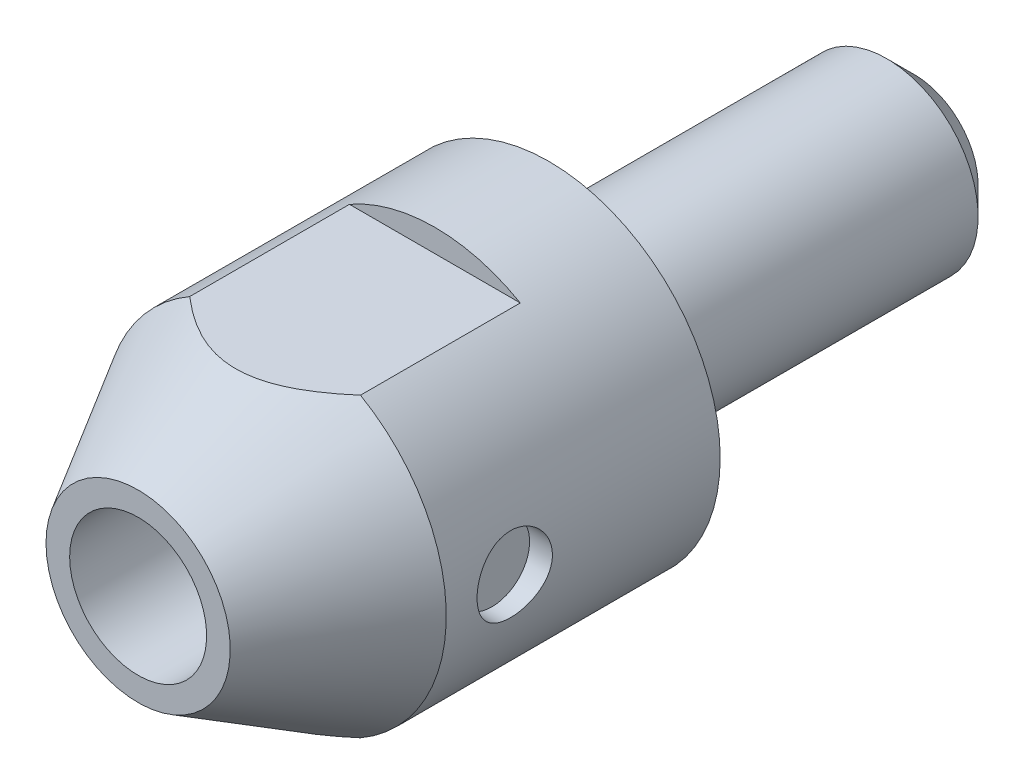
ISO-10303-21;
HEADER;
FILE_DESCRIPTION(('STEP AP214'),'2;1');
FILE_NAME('part.step','',(''),(''),'','','');
FILE_SCHEMA(('AUTOMOTIVE_DESIGN { 1 0 10303 214 1 1 1 1 }'));
ENDSEC;
DATA;
#1=APPLICATION_CONTEXT('core data for automotive mechanical design processes');
#2=APPLICATION_PROTOCOL_DEFINITION('international standard','automotive_design',2000,#1);
#3=PRODUCT_CONTEXT('',#1,'mechanical');
#4=PRODUCT('Part','Part','',(#3));
#5=PRODUCT_RELATED_PRODUCT_CATEGORY('part','',(#4));
#6=PRODUCT_DEFINITION_FORMATION('','',#4);
#7=PRODUCT_DEFINITION_CONTEXT('part definition',#1,'design');
#8=PRODUCT_DEFINITION('design','',#6,#7);
#9=PRODUCT_DEFINITION_SHAPE('','',#8);
#10=(LENGTH_UNIT() NAMED_UNIT(*) SI_UNIT(.MILLI.,.METRE.));
#11=(NAMED_UNIT(*) PLANE_ANGLE_UNIT() SI_UNIT($,.RADIAN.));
#12=(NAMED_UNIT(*) SI_UNIT($,.STERADIAN.) SOLID_ANGLE_UNIT());
#13=UNCERTAINTY_MEASURE_WITH_UNIT(LENGTH_MEASURE(1.E-05),#10,'distance_accuracy_value','');
#14=(GEOMETRIC_REPRESENTATION_CONTEXT(3) GLOBAL_UNCERTAINTY_ASSIGNED_CONTEXT((#13)) GLOBAL_UNIT_ASSIGNED_CONTEXT((#10,
#11,#12)) REPRESENTATION_CONTEXT('',''));
#15=CARTESIAN_POINT('',(0.,0.,0.));
#16=DIRECTION('',(0.,0.,1.));
#17=DIRECTION('',(1.,0.,0.));
#18=AXIS2_PLACEMENT_3D('',#15,#16,#17);
#19=CARTESIAN_POINT('',(-12.6621649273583,0.,9.));
#20=DIRECTION('',(-1.,0.,0.));
#21=DIRECTION('',(0.,0.,1.));
#22=AXIS2_PLACEMENT_3D('',#19,#20,#21);
#23=CYLINDRICAL_SURFACE('',#22,1.65);
#24=CARTESIAN_POINT('',(7.5,0.,10.65));
#25=CARTESIAN_POINT('',(7.49999831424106,0.0914999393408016,10.6499968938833));
#26=CARTESIAN_POINT('',(7.49830854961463,0.183037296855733,10.6423631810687));
#27=CARTESIAN_POINT('',(7.49173097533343,0.363511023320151,10.6120622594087));
#28=CARTESIAN_POINT('',(7.4868408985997,0.452445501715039,10.5893843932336));
#29=CARTESIAN_POINT('',(7.47440705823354,0.625079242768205,10.5297405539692));
#30=CARTESIAN_POINT('',(7.46686608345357,0.708783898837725,10.4927895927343));
#31=CARTESIAN_POINT('',(7.4499439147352,0.868802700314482,10.4056963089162));
#32=CARTESIAN_POINT('',(7.44056276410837,0.945117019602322,10.3555542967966));
#33=CARTESIAN_POINT('',(7.42081741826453,1.08942970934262,10.2426414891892));
#34=CARTESIAN_POINT('',(7.41044091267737,1.15729102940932,10.1796976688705));
#35=CARTESIAN_POINT('',(7.38996090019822,1.28158292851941,10.0433394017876));
#36=CARTESIAN_POINT('',(7.3798574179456,1.33801247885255,9.96992401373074));
#37=CARTESIAN_POINT('',(7.36094592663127,1.43844520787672,9.81369134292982));
#38=CARTESIAN_POINT('',(7.35215368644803,1.48230220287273,9.73077800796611));
#39=CARTESIAN_POINT('',(7.33703697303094,1.55540709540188,9.55853274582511));
#40=CARTESIAN_POINT('',(7.33071220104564,1.58465676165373,9.46920159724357));
#41=CARTESIAN_POINT('',(7.32137195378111,1.62726320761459,9.28814395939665));
#42=CARTESIAN_POINT('',(7.31830597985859,1.64086278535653,9.19647726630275));
#43=CARTESIAN_POINT('',(7.31567882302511,1.65253801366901,9.01211606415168));
#44=CARTESIAN_POINT('',(7.31611720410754,1.65061559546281,8.91942168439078));
#45=CARTESIAN_POINT('',(7.32040352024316,1.63149672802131,8.73744348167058));
#46=CARTESIAN_POINT('',(7.32418842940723,1.61458260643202,8.64812828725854));
#47=CARTESIAN_POINT('',(7.33464165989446,1.56640787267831,8.47363508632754));
#48=CARTESIAN_POINT('',(7.34131014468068,1.53514644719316,8.38845731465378));
#49=CARTESIAN_POINT('',(7.35684109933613,1.45890598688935,8.22386456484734));
#50=CARTESIAN_POINT('',(7.36572078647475,1.41381862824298,8.14450145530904));
#51=CARTESIAN_POINT('',(7.38466310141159,1.31128231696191,7.99436318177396));
#52=CARTESIAN_POINT('',(7.39472589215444,1.25383166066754,7.92358920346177));
#53=CARTESIAN_POINT('',(7.41517081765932,1.12670629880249,7.7910130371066));
#54=CARTESIAN_POINT('',(7.42555512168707,1.05679158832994,7.72944109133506));
#55=CARTESIAN_POINT('',(7.44527255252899,0.907510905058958,7.61885837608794));
#56=CARTESIAN_POINT('',(7.45460565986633,0.828144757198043,7.56984783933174));
#57=CARTESIAN_POINT('',(7.4711999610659,0.661931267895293,7.48572123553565));
#58=CARTESIAN_POINT('',(7.47845660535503,0.575068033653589,7.45063561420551));
#59=CARTESIAN_POINT('',(7.49004657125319,0.396483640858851,7.39562258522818));
#60=CARTESIAN_POINT('',(7.49438032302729,0.304763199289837,7.37569294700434));
#61=CARTESIAN_POINT('',(7.49957488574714,0.121042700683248,7.35189313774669));
#62=CARTESIAN_POINT('',(7.50050369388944,0.0290852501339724,7.34770849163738));
#63=CARTESIAN_POINT('',(7.49897438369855,-0.154214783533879,7.35466469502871));
#64=CARTESIAN_POINT('',(7.4965164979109,-0.245557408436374,7.3658044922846));
#65=CARTESIAN_POINT('',(7.48853291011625,-0.423991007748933,7.40283265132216));
#66=CARTESIAN_POINT('',(7.48304158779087,-0.511117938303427,7.42855581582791));
#67=CARTESIAN_POINT('',(7.46960587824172,-0.679820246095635,7.49383695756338));
#68=CARTESIAN_POINT('',(7.46166128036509,-0.761395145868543,7.5333961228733));
#69=CARTESIAN_POINT('',(7.44403270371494,-0.917976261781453,7.62587978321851));
#70=CARTESIAN_POINT('',(7.43432530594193,-0.992870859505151,7.6789886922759));
#71=CARTESIAN_POINT('',(7.41429527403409,-1.13279771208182,7.79682171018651));
#72=CARTESIAN_POINT('',(7.40397255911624,-1.19782866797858,7.86154734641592));
#73=CARTESIAN_POINT('',(7.38364007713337,-1.31742759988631,8.00222027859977));
#74=CARTESIAN_POINT('',(7.373639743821,-1.37177769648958,8.07835443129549));
#75=CARTESIAN_POINT('',(7.35530407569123,-1.46692164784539,8.23885442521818));
#76=CARTESIAN_POINT('',(7.34696866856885,-1.50771609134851,8.32321990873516));
#77=CARTESIAN_POINT('',(7.33298679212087,-1.57431369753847,8.49733416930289));
#78=CARTESIAN_POINT('',(7.32732517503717,-1.60020149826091,8.58704929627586));
#79=CARTESIAN_POINT('',(7.31930499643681,-1.63649815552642,8.76969698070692));
#80=CARTESIAN_POINT('',(7.3169458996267,-1.64690952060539,8.86262901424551));
#81=CARTESIAN_POINT('',(7.31583187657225,-1.6518500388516,9.0468749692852));
#82=CARTESIAN_POINT('',(7.3169985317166,-1.64672474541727,9.13817931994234));
#83=CARTESIAN_POINT('',(7.32262705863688,-1.62151064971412,9.31858911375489));
#84=CARTESIAN_POINT('',(7.3270888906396,-1.60142202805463,9.40769458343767));
#85=CARTESIAN_POINT('',(7.33876659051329,-1.54701934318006,9.58089887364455));
#86=CARTESIAN_POINT('',(7.34597260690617,-1.5127561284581,9.66501437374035));
#87=CARTESIAN_POINT('',(7.36233049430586,-1.4310203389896,9.82635416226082));
#88=CARTESIAN_POINT('',(7.37148257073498,-1.38354636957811,9.90357772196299));
#89=CARTESIAN_POINT('',(7.39093521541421,-1.27559296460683,10.0506437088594));
#90=CARTESIAN_POINT('',(7.40125543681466,-1.21486750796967,10.1203029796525));
#91=CARTESIAN_POINT('',(7.42175007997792,-1.08263275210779,10.2485559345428));
#92=CARTESIAN_POINT('',(7.43192446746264,-1.01112096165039,10.3071470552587));
#93=CARTESIAN_POINT('',(7.45113988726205,-0.858209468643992,10.4123391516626));
#94=CARTESIAN_POINT('',(7.46016424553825,-0.776692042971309,10.4587722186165));
#95=CARTESIAN_POINT('',(7.47589523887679,-0.606827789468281,10.5372038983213));
#96=CARTESIAN_POINT('',(7.48260380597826,-0.518486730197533,10.5692145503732));
#97=CARTESIAN_POINT('',(7.4917581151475,-0.358388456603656,10.6122237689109));
#98=CARTESIAN_POINT('',(7.4948296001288,-0.287493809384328,10.6263626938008));
#99=CARTESIAN_POINT('',(7.49895116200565,-0.144407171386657,10.645251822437));
#100=CARTESIAN_POINT('',(7.5000013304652,-0.072215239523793,10.6500024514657));
#101=CARTESIAN_POINT('',(7.5,0.,10.65));
#102=B_SPLINE_CURVE_WITH_KNOTS('',3,(#24,#25,#26,#27,#28,#29,#30,#31,#32,#33,#34,#35,#36,#37,
#38,#39,#40,#41,#42,#43,#44,#45,#46,#47,#48,#49,#50,#51,#52,#53,#54,#55,#56,#57,#58,#59,#60,#61,
#62,#63,#64,#65,#66,#67,#68,#69,#70,#71,#72,#73,#74,#75,#76,#77,#78,#79,#80,#81,#82,#83,#84,#85,
#86,#87,#88,#89,#90,#91,#92,#93,#94,#95,#96,#97,#98,#99,#100,#101),.UNSPECIFIED.,.T.,.F.,(4,2,2,
2,2,2,2,2,2,2,2,2,2,2,2,2,2,2,2,2,2,2,2,2,2,2,2,2,2,2,2,2,2,2,2,2,2,2,4),(0.,0.27423546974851,
0.548665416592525,0.822807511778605,1.09694315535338,1.37506480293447,1.65321146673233,
1.93447194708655,2.21569836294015,2.49250033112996,2.76926786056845,3.04093142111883,
3.31261038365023,3.5864747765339,3.86037693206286,4.14027337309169,4.42017499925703,
4.70068528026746,4.98115426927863,5.25599076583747,5.53080839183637,5.80257342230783,
6.07436179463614,6.35006739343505,6.62580926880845,6.90669641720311,7.18757136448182,
7.466835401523,7.74605416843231,8.0191086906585,8.29215991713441,8.56424000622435,
8.83634882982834,9.11402013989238,9.39175567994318,9.67314563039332,9.95430024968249,
10.1707471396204,10.3871842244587),.UNSPECIFIED.);
#103=CARTESIAN_POINT('',(7.5,0.,10.65));
#104=VERTEX_POINT('',#103);
#105=EDGE_CURVE('E161',#104,#104,#102,.T.);
#106=ORIENTED_EDGE('',*,*,#105,.F.);
#107=EDGE_LOOP('',(#106));
#108=FACE_BOUND('',#107,.T.);
#109=CARTESIAN_POINT('',(6.5,0.,9.));
#110=DIRECTION('',(-1.,0.,0.));
#111=DIRECTION('',(0.,0.,1.));
#112=AXIS2_PLACEMENT_3D('',#109,#110,#111);
#113=CIRCLE('',#112,1.65);
#114=CARTESIAN_POINT('',(6.5,0.,10.65));
#115=VERTEX_POINT('',#114);
#116=EDGE_CURVE('E10',#115,#115,#113,.F.);
#117=ORIENTED_EDGE('',*,*,#116,.F.);
#118=EDGE_LOOP('',(#117));
#119=FACE_BOUND('',#118,.T.);
#120=ADVANCED_FACE('F16',(#108,#119),#23,.F.);
#121=CARTESIAN_POINT('',(0.,0.,-38.3689686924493));
#122=DIRECTION('',(0.,0.,-1.));
#123=DIRECTION('',(-1.,0.,0.));
#124=AXIS2_PLACEMENT_3D('',#121,#122,#123);
#125=CYLINDRICAL_SURFACE('',#124,7.5);
#126=CARTESIAN_POINT('',(0.,0.,0.));
#127=DIRECTION('',(0.,0.,-1.));
#128=DIRECTION('',(-1.,0.,0.));
#129=AXIS2_PLACEMENT_3D('',#126,#127,#128);
#130=CIRCLE('',#129,7.5);
#131=CARTESIAN_POINT('',(-7.5,0.,0.));
#132=VERTEX_POINT('',#131);
#133=EDGE_CURVE('E209',#132,#132,#130,.T.);
#134=ORIENTED_EDGE('',*,*,#133,.F.);
#135=EDGE_LOOP('',(#134));
#136=FACE_BOUND('',#135,.T.);
#137=CARTESIAN_POINT('',(0.,0.,12.));
#138=DIRECTION('',(0.,0.,-1.));
#139=DIRECTION('',(-1.,0.,0.));
#140=AXIS2_PLACEMENT_3D('',#137,#138,#139);
#141=CIRCLE('',#140,7.5);
#142=CARTESIAN_POINT('',(3.74165738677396,6.5,12.));
#143=VERTEX_POINT('',#142);
#144=CARTESIAN_POINT('',(3.74165738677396,-6.5,12.));
#145=VERTEX_POINT('',#144);
#146=EDGE_CURVE('E213',#143,#145,#141,.T.);
#147=ORIENTED_EDGE('',*,*,#146,.T.);
#148=DIRECTION('',(0.,0.,-1.));
#149=VECTOR('',#148,1.);
#150=CARTESIAN_POINT('',(3.74165738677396,-6.5,-38.3689686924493));
#151=LINE('',#150,#149);
#152=CARTESIAN_POINT('',(3.74165738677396,-6.5,5.));
#153=VERTEX_POINT('',#152);
#154=EDGE_CURVE('E238',#145,#153,#151,.T.);
#155=ORIENTED_EDGE('',*,*,#154,.T.);
#156=CARTESIAN_POINT('',(0.,0.,5.));
#157=DIRECTION('',(0.,0.,1.));
#158=DIRECTION('',(1.,0.,0.));
#159=AXIS2_PLACEMENT_3D('',#156,#157,#158);
#160=CIRCLE('',#159,7.5);
#161=CARTESIAN_POINT('',(-3.74165738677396,-6.5,5.));
#162=VERTEX_POINT('',#161);
#163=EDGE_CURVE('E233',#162,#153,#160,.T.);
#164=ORIENTED_EDGE('',*,*,#163,.F.);
#165=DIRECTION('',(0.,0.,-1.));
#166=VECTOR('',#165,1.);
#167=CARTESIAN_POINT('',(-3.74165738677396,-6.5,-38.3689686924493));
#168=LINE('',#167,#166);
#169=CARTESIAN_POINT('',(-3.74165738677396,-6.5,12.));
#170=VERTEX_POINT('',#169);
#171=EDGE_CURVE('E235',#162,#170,#168,.F.);
#172=ORIENTED_EDGE('',*,*,#171,.T.);
#173=CARTESIAN_POINT('',(-3.74165738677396,6.5,12.));
#174=VERTEX_POINT('',#173);
#175=EDGE_CURVE('E212',#170,#174,#141,.T.);
#176=ORIENTED_EDGE('',*,*,#175,.T.);
#177=DIRECTION('',(0.,0.,-1.));
#178=VECTOR('',#177,1.);
#179=CARTESIAN_POINT('',(-3.74165738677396,6.5,-38.3689686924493));
#180=LINE('',#179,#178);
#181=CARTESIAN_POINT('',(-3.74165738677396,6.5,5.));
#182=VERTEX_POINT('',#181);
#183=EDGE_CURVE('E230',#174,#182,#180,.T.);
#184=ORIENTED_EDGE('',*,*,#183,.T.);
#185=CARTESIAN_POINT('',(0.,0.,5.));
#186=DIRECTION('',(0.,0.,1.));
#187=DIRECTION('',(1.,0.,0.));
#188=AXIS2_PLACEMENT_3D('',#185,#186,#187);
#189=CIRCLE('',#188,7.5);
#190=CARTESIAN_POINT('',(3.74165738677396,6.5,5.));
#191=VERTEX_POINT('',#190);
#192=EDGE_CURVE('E225',#191,#182,#189,.T.);
#193=ORIENTED_EDGE('',*,*,#192,.F.);
#194=DIRECTION('',(0.,0.,-1.));
#195=VECTOR('',#194,1.);
#196=CARTESIAN_POINT('',(3.74165738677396,6.5,-38.3689686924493));
#197=LINE('',#196,#195);
#198=EDGE_CURVE('E227',#191,#143,#197,.F.);
#199=ORIENTED_EDGE('',*,*,#198,.T.);
#200=EDGE_LOOP('',(#147,#155,#164,#172,#176,#184,#193,#199));
#201=FACE_BOUND('',#200,.T.);
#202=ORIENTED_EDGE('',*,*,#105,.T.);
#203=EDGE_LOOP('',(#202));
#204=FACE_BOUND('',#203,.T.);
#205=CARTESIAN_POINT('',(-7.5,0.,10.0196551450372));
#206=CARTESIAN_POINT('',(-7.49999815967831,0.112035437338,10.0196526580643));
#207=CARTESIAN_POINT('',(-7.49746541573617,0.224101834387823,10.0104770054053));
#208=CARTESIAN_POINT('',(-7.48760100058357,0.445065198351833,9.97400781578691));
#209=CARTESIAN_POINT('',(-7.48026698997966,0.553960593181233,9.94670544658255));
#210=CARTESIAN_POINT('',(-7.46159520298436,0.765415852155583,9.87471725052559));
#211=CARTESIAN_POINT('',(-7.4502595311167,0.867979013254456,9.83004055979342));
#212=CARTESIAN_POINT('',(-7.42480411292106,1.06398412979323,9.7244409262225));
#213=CARTESIAN_POINT('',(-7.41068441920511,1.1574262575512,9.66351829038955));
#214=CARTESIAN_POINT('',(-7.38111530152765,1.33308802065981,9.52657346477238));
#215=CARTESIAN_POINT('',(-7.36565918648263,1.41524513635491,9.450472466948));
#216=CARTESIAN_POINT('',(-7.33521511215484,1.56540829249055,9.28531014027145));
#217=CARTESIAN_POINT('',(-7.32022712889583,1.63341505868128,9.19624947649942));
#218=CARTESIAN_POINT('',(-7.29254399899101,1.75286903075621,9.00819917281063));
#219=CARTESIAN_POINT('',(-7.2798335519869,1.80442870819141,8.90928331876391));
#220=CARTESIAN_POINT('',(-7.25805924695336,1.89011767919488,8.70380566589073));
#221=CARTESIAN_POINT('',(-7.24899468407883,1.92425034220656,8.59724534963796));
#222=CARTESIAN_POINT('',(-7.23569834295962,1.97365524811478,8.3819641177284));
#223=CARTESIAN_POINT('',(-7.23136755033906,1.98931447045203,8.27333785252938));
#224=CARTESIAN_POINT('',(-7.22762203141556,2.0028804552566,8.05490996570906));
#225=CARTESIAN_POINT('',(-7.22820739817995,2.00078688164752,7.94510832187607));
#226=CARTESIAN_POINT('',(-7.2341453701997,1.97920713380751,7.72696682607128));
#227=CARTESIAN_POINT('',(-7.23951578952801,1.95965596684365,7.61863397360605));
#228=CARTESIAN_POINT('',(-7.25436749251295,1.90393658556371,7.40662835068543));
#229=CARTESIAN_POINT('',(-7.26384974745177,1.86776444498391,7.30295668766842));
#230=CARTESIAN_POINT('',(-7.28635469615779,1.77799391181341,7.09834186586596));
#231=CARTESIAN_POINT('',(-7.29951483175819,1.7236986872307,6.99771955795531));
#232=CARTESIAN_POINT('',(-7.32769468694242,1.5996643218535,6.80675519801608));
#233=CARTESIAN_POINT('',(-7.34271496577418,1.52992053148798,6.71641625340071));
#234=CARTESIAN_POINT('',(-7.37355344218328,1.37377563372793,6.54532048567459));
#235=CARTESIAN_POINT('',(-7.38938075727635,1.28685961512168,6.46503353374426));
#236=CARTESIAN_POINT('',(-7.4194621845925,1.10022453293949,6.32064252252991));
#237=CARTESIAN_POINT('',(-7.43371652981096,1.00050737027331,6.25653606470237));
#238=CARTESIAN_POINT('',(-7.45858563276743,0.793746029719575,6.14846063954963));
#239=CARTESIAN_POINT('',(-7.46928896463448,0.686975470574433,6.10399064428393));
#240=CARTESIAN_POINT('',(-7.48626258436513,0.466921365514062,6.03466639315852));
#241=CARTESIAN_POINT('',(-7.49253535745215,0.353641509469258,6.00980113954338));
#242=CARTESIAN_POINT('',(-7.49959575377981,0.132224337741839,5.98189545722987));
#243=CARTESIAN_POINT('',(-7.50073204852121,0.0242716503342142,5.97746725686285));
#244=CARTESIAN_POINT('',(-7.49834383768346,-0.190772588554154,5.98685322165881));
#245=CARTESIAN_POINT('',(-7.49482014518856,-0.297864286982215,6.0006642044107));
#246=CARTESIAN_POINT('',(-7.48369023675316,-0.504778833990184,6.04520076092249));
#247=CARTESIAN_POINT('',(-7.47621204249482,-0.604723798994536,6.07539665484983));
#248=CARTESIAN_POINT('',(-7.45802983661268,-0.798279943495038,6.15115705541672));
#249=CARTESIAN_POINT('',(-7.44732530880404,-0.891890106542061,6.1967240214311));
#250=CARTESIAN_POINT('',(-7.42325913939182,-1.07425634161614,6.30380040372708));
#251=CARTESIAN_POINT('',(-7.40980826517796,-1.16266795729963,6.36587512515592));
#252=CARTESIAN_POINT('',(-7.38188083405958,-1.32850317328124,6.50309789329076));
#253=CARTESIAN_POINT('',(-7.36740391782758,-1.40592289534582,6.5782505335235));
#254=CARTESIAN_POINT('',(-7.33785540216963,-1.553025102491,6.74512700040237));
#255=CARTESIAN_POINT('',(-7.32280945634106,-1.62183479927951,6.83762618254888));
#256=CARTESIAN_POINT('',(-7.29479126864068,-1.74354022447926,7.03286769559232));
#257=CARTESIAN_POINT('',(-7.28181948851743,-1.79643241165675,7.13561229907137));
#258=CARTESIAN_POINT('',(-7.25915438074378,-1.88596912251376,7.35152201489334));
#259=CARTESIAN_POINT('',(-7.24955568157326,-1.92215247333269,7.46488939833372));
#260=CARTESIAN_POINT('',(-7.23540110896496,-1.97477282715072,7.69642408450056));
#261=CARTESIAN_POINT('',(-7.23084376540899,-1.99121558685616,7.81458997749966));
#262=CARTESIAN_POINT('',(-7.2275386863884,-2.00317761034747,8.04768937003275));
#263=CARTESIAN_POINT('',(-7.22858259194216,-1.999447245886,8.16258105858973));
#264=CARTESIAN_POINT('',(-7.23597135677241,-1.97253954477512,8.38988362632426));
#265=CARTESIAN_POINT('',(-7.24231485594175,-1.94936719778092,8.50229513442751));
#266=CARTESIAN_POINT('',(-7.25919799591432,-1.88548984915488,8.71643629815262));
#267=CARTESIAN_POINT('',(-7.26954776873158,-1.84557214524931,8.81841690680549));
#268=CARTESIAN_POINT('',(-7.29326976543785,-1.74947242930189,9.01401463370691));
#269=CARTESIAN_POINT('',(-7.30664200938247,-1.69329030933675,9.10763169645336));
#270=CARTESIAN_POINT('',(-7.33493173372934,-1.56620632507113,9.28407920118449));
#271=CARTESIAN_POINT('',(-7.34985011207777,-1.49529588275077,9.36690331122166));
#272=CARTESIAN_POINT('',(-7.37961244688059,-1.34071059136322,9.51966754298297));
#273=CARTESIAN_POINT('',(-7.39445638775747,-1.25703317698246,9.58960506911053));
#274=CARTESIAN_POINT('',(-7.42280239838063,-1.07724301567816,9.71625494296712));
#275=CARTESIAN_POINT('',(-7.4362688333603,-0.98090193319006,9.77265125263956));
#276=CARTESIAN_POINT('',(-7.46002249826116,-0.779923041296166,9.86880738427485));
#277=CARTESIAN_POINT('',(-7.47031119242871,-0.675289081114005,9.90857487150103));
#278=CARTESIAN_POINT('',(-7.48545158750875,-0.475966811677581,9.96606774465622));
#279=CARTESIAN_POINT('',(-7.49086925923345,-0.381986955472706,9.98612713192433));
#280=CARTESIAN_POINT('',(-7.49814421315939,-0.192012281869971,10.0129217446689));
#281=CARTESIAN_POINT('',(-7.50000157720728,-0.0960175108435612,10.0196572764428));
#282=CARTESIAN_POINT('',(-7.5,0.,10.0196551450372));
#283=B_SPLINE_CURVE_WITH_KNOTS('',3,(#205,#206,#207,#208,#209,#210,#211,#212,#213,#214,#215,
#216,#217,#218,#219,#220,#221,#222,#223,#224,#225,#226,#227,#228,#229,#230,#231,#232,#233,#234,
#235,#236,#237,#238,#239,#240,#241,#242,#243,#244,#245,#246,#247,#248,#249,#250,#251,#252,#253,
#254,#255,#256,#257,#258,#259,#260,#261,#262,#263,#264,#265,#266,#267,#268,#269,#270,#271,#272,
#273,#274,#275,#276,#277,#278,#279,#280,#281,#282),.UNSPECIFIED.,.T.,.F.,(4,2,2,2,2,2,2,2,2,2,2,
2,2,2,2,2,2,2,2,2,2,2,2,2,2,2,2,2,2,2,2,2,2,2,2,2,2,2,4),(0.,0.335760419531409,
0.671684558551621,1.00743229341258,1.34317368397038,1.68070592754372,2.01822085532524,
2.35337562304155,2.68846556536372,3.01640388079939,3.34434840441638,3.67351894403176,
4.00276728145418,4.34650499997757,4.69034631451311,5.04673294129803,5.40306670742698,
5.74969285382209,6.09612441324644,6.41864763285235,6.74111458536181,7.0537292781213,
7.36639401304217,7.69157841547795,8.01687726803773,8.36409409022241,8.7113881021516,
9.06776618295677,9.42404031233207,9.76715557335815,10.110182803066,10.438626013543,
10.7670714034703,11.0957086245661,11.4244119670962,11.76016963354,12.0957723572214,
12.3835350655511,12.6712911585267),.UNSPECIFIED.);
#284=CARTESIAN_POINT('',(-7.5,0.,10.0196551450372));
#285=VERTEX_POINT('',#284);
#286=EDGE_CURVE('E24',#285,#285,#283,.T.);
#287=ORIENTED_EDGE('',*,*,#286,.F.);
#288=EDGE_LOOP('',(#287));
#289=FACE_BOUND('',#288,.T.);
#290=ADVANCED_FACE('F249',(#136,#201,#204,#289),#125,.T.);
#291=CARTESIAN_POINT('',(0.,0.,-38.3689686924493));
#292=DIRECTION('',(0.,0.,-1.));
#293=DIRECTION('',(-1.,0.,0.));
#294=AXIS2_PLACEMENT_3D('',#291,#292,#293);
#295=CYLINDRICAL_SURFACE('',#294,4.);
#296=CARTESIAN_POINT('',(0.,0.,-14.8));
#297=DIRECTION('',(0.,0.,-1.));
#298=DIRECTION('',(-1.,0.,0.));
#299=AXIS2_PLACEMENT_3D('',#296,#297,#298);
#300=CIRCLE('',#299,4.);
#301=CARTESIAN_POINT('',(-4.,0.,-14.8));
#302=VERTEX_POINT('',#301);
#303=EDGE_CURVE('E206',#302,#302,#300,.T.);
#304=ORIENTED_EDGE('',*,*,#303,.F.);
#305=EDGE_LOOP('',(#304));
#306=FACE_BOUND('',#305,.T.);
#307=CARTESIAN_POINT('',(0.,0.,0.));
#308=DIRECTION('',(0.,0.,1.));
#309=DIRECTION('',(1.,0.,0.));
#310=AXIS2_PLACEMENT_3D('',#307,#308,#309);
#311=CIRCLE('',#310,4.);
#312=CARTESIAN_POINT('',(4.,0.,0.));
#313=VERTEX_POINT('',#312);
#314=EDGE_CURVE('E158',#313,#313,#311,.F.);
#315=ORIENTED_EDGE('',*,*,#314,.T.);
#316=EDGE_LOOP('',(#315));
#317=FACE_BOUND('',#316,.T.);
#318=ADVANCED_FACE('F404',(#306,#317),#295,.T.);
#319=CARTESIAN_POINT('',(0.,0.,-14.8));
#320=DIRECTION('',(0.,0.,1.));
#321=DIRECTION('',(1.,0.,0.));
#322=AXIS2_PLACEMENT_3D('',#319,#320,#321);
#323=CONICAL_SURFACE('',#322,4.,0.785398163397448);
#324=CARTESIAN_POINT('',(0.,0.,-16.));
#325=DIRECTION('',(0.,0.,-1.));
#326=DIRECTION('',(-1.,0.,0.));
#327=AXIS2_PLACEMENT_3D('',#324,#325,#326);
#328=CIRCLE('',#327,2.8);
#329=CARTESIAN_POINT('',(-2.8,0.,-16.));
#330=VERTEX_POINT('',#329);
#331=EDGE_CURVE('E203',#330,#330,#328,.T.);
#332=ORIENTED_EDGE('',*,*,#331,.F.);
#333=EDGE_LOOP('',(#332));
#334=FACE_BOUND('',#333,.T.);
#335=ORIENTED_EDGE('',*,*,#303,.T.);
#336=EDGE_LOOP('',(#335));
#337=FACE_BOUND('',#336,.T.);
#338=ADVANCED_FACE('F413',(#334,#337),#323,.T.);
#339=CARTESIAN_POINT('',(2.8,0.,-16.));
#340=DIRECTION('',(0.,0.,1.));
#341=DIRECTION('',(1.,0.,0.));
#342=AXIS2_PLACEMENT_3D('',#339,#340,#341);
#343=PLANE('',#342);
#344=ORIENTED_EDGE('',*,*,#331,.T.);
#345=EDGE_LOOP('',(#344));
#346=FACE_BOUND('',#345,.T.);
#347=ADVANCED_FACE('F194',(#346),#343,.F.);
#348=CARTESIAN_POINT('',(3.,0.,18.));
#349=DIRECTION('',(0.,0.,-1.));
#350=DIRECTION('',(-1.,0.,0.));
#351=AXIS2_PLACEMENT_3D('',#348,#349,#350);
#352=PLANE('',#351);
#353=CARTESIAN_POINT('',(0.,0.,18.));
#354=DIRECTION('',(0.,0.,-1.));
#355=DIRECTION('',(-1.,0.,0.));
#356=AXIS2_PLACEMENT_3D('',#353,#354,#355);
#357=CIRCLE('',#356,4.03589838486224);
#358=CARTESIAN_POINT('',(-4.03589838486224,0.,18.));
#359=VERTEX_POINT('',#358);
#360=EDGE_CURVE('E216',#359,#359,#357,.T.);
#361=ORIENTED_EDGE('',*,*,#360,.F.);
#362=EDGE_LOOP('',(#361));
#363=FACE_BOUND('',#362,.T.);
#364=CARTESIAN_POINT('',(0.,0.,18.));
#365=DIRECTION('',(0.,0.,-1.));
#366=DIRECTION('',(-1.,0.,0.));
#367=AXIS2_PLACEMENT_3D('',#364,#365,#366);
#368=CIRCLE('',#367,3.);
#369=CARTESIAN_POINT('',(-3.,0.,18.));
#370=VERTEX_POINT('',#369);
#371=EDGE_CURVE('E219',#370,#370,#368,.T.);
#372=ORIENTED_EDGE('',*,*,#371,.T.);
#373=EDGE_LOOP('',(#372));
#374=FACE_BOUND('',#373,.T.);
#375=ADVANCED_FACE('F189',(#363,#374),#352,.F.);
#376=CARTESIAN_POINT('',(-9.6,6.5,5.));
#377=DIRECTION('',(0.,0.,1.));
#378=DIRECTION('',(1.,0.,0.));
#379=AXIS2_PLACEMENT_3D('',#376,#377,#378);
#380=PLANE('',#379);
#381=ORIENTED_EDGE('',*,*,#192,.T.);
#382=DIRECTION('',(1.,0.,0.));
#383=VECTOR('',#382,1.);
#384=CARTESIAN_POINT('',(-9.6,6.5,5.));
#385=LINE('',#384,#383);
#386=EDGE_CURVE('E37',#182,#191,#385,.T.);
#387=ORIENTED_EDGE('',*,*,#386,.T.);
#388=EDGE_LOOP('',(#381,#387));
#389=FACE_BOUND('',#388,.T.);
#390=ADVANCED_FACE('F185',(#389),#380,.T.);
#391=CARTESIAN_POINT('',(-9.6,6.5,5.));
#392=DIRECTION('',(0.,-1.,0.));
#393=DIRECTION('',(0.,0.,-1.));
#394=AXIS2_PLACEMENT_3D('',#391,#392,#393);
#395=PLANE('',#394);
#396=CARTESIAN_POINT('',(-9.35809838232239,6.5,5.2553356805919));
#397=CARTESIAN_POINT('',(-9.19191981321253,6.5,5.4917084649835));
#398=CARTESIAN_POINT('',(-9.02479859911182,6.5,5.72742378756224));
#399=CARTESIAN_POINT('',(-8.6883280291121,6.5,6.19726699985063));
#400=CARTESIAN_POINT('',(-8.51897861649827,6.5,6.43139484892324));
#401=CARTESIAN_POINT('',(-8.17727099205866,6.5,6.89838838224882));
#402=CARTESIAN_POINT('',(-8.00490606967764,6.5,7.13124916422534));
#403=CARTESIAN_POINT('',(-7.65715770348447,6.5,7.59471575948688));
#404=CARTESIAN_POINT('',(-7.48177420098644,6.5,7.82532152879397));
#405=CARTESIAN_POINT('',(-7.11385053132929,6.5,8.30139308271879));
#406=CARTESIAN_POINT('',(-6.92102696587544,6.5,8.54664041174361));
#407=CARTESIAN_POINT('',(-6.53041673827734,6.5,9.03313385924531));
#408=CARTESIAN_POINT('',(-6.33263040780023,6.5,9.27438024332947));
#409=CARTESIAN_POINT('',(-5.93121046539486,6.5,9.75148921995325));
#410=CARTESIAN_POINT('',(-5.72758414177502,6.5,9.98735791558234));
#411=CARTESIAN_POINT('',(-5.31282641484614,6.5,10.4523819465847));
#412=CARTESIAN_POINT('',(-5.10169572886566,6.5,10.6815379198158));
#413=CARTESIAN_POINT('',(-4.65558229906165,6.5,11.1458412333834));
#414=CARTESIAN_POINT('',(-4.41994753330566,6.5,11.3803709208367));
#415=CARTESIAN_POINT('',(-4.05617177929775,6.5,11.7209934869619));
#416=CARTESIAN_POINT('',(-3.93323025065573,6.5,11.8326411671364));
#417=CARTESIAN_POINT('',(-3.68335894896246,6.5,12.0514297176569));
#418=CARTESIAN_POINT('',(-3.55642878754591,6.5,12.1585701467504));
#419=CARTESIAN_POINT('',(-3.30036232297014,6.5,12.365429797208));
#420=CARTESIAN_POINT('',(-3.17130580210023,6.5,12.4652473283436));
#421=CARTESIAN_POINT('',(-2.90832306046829,6.5,12.6582087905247));
#422=CARTESIAN_POINT('',(-2.77439830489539,6.5,12.7513547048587));
#423=CARTESIAN_POINT('',(-2.5014431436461,6.5,12.9291294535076));
#424=CARTESIAN_POINT('',(-2.36242614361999,6.5,13.0137787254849));
#425=CARTESIAN_POINT('',(-2.07861608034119,6.5,13.1726864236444));
#426=CARTESIAN_POINT('',(-1.93382688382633,6.5,13.2469516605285));
#427=CARTESIAN_POINT('',(-1.67922365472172,6.5,13.3637929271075));
#428=CARTESIAN_POINT('',(-1.57082517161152,6.5,13.4094497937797));
#429=CARTESIAN_POINT('',(-1.35102129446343,6.5,13.4929336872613));
#430=CARTESIAN_POINT('',(-1.23961580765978,6.5,13.5307604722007));
#431=CARTESIAN_POINT('',(-1.01424777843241,6.5,13.5974371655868));
#432=CARTESIAN_POINT('',(-0.900287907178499,6.5,13.6262960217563));
#433=CARTESIAN_POINT('',(-0.670308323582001,6.5,13.6740710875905));
#434=CARTESIAN_POINT('',(-0.554289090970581,6.5,13.6929895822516));
#435=CARTESIAN_POINT('',(-0.320007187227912,6.5,13.7202476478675));
#436=CARTESIAN_POINT('',(-0.201733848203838,6.5,13.7284966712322));
#437=CARTESIAN_POINT('',(0.035060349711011,6.5,13.7337543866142));
#438=CARTESIAN_POINT('',(0.153581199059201,6.5,13.7307635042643));
#439=CARTESIAN_POINT('',(0.389880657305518,6.5,13.7136712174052));
#440=CARTESIAN_POINT('',(0.50765879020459,6.5,13.6995632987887));
#441=CARTESIAN_POINT('',(0.741466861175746,6.5,13.6608331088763));
#442=CARTESIAN_POINT('',(0.857496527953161,6.5,13.6362092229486));
#443=CARTESIAN_POINT('',(1.11262531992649,6.5,13.5708348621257));
#444=CARTESIAN_POINT('',(1.25111628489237,6.5,13.5277158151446));
#445=CARTESIAN_POINT('',(1.52366852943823,6.5,13.4291827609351));
#446=CARTESIAN_POINT('',(1.65772728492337,6.5,13.3737618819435));
#447=CARTESIAN_POINT('',(1.92144625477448,6.5,13.2525263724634));
#448=CARTESIAN_POINT('',(2.05109380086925,6.5,13.1866844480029));
#449=CARTESIAN_POINT('',(2.3056847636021,6.5,13.0465607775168));
#450=CARTESIAN_POINT('',(2.43062858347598,6.5,12.9722797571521));
#451=CARTESIAN_POINT('',(2.71377760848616,6.5,12.792970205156));
#452=CARTESIAN_POINT('',(2.87043024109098,6.5,12.6854989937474));
#453=CARTESIAN_POINT('',(3.17711429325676,6.5,12.4614477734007));
#454=CARTESIAN_POINT('',(3.32714262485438,6.5,12.3448635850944));
#455=CARTESIAN_POINT('',(3.62163685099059,6.5,12.10441583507));
#456=CARTESIAN_POINT('',(3.76609291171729,6.5,11.9805402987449));
#457=CARTESIAN_POINT('',(4.04999178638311,6.5,11.7271645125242));
#458=CARTESIAN_POINT('',(4.18943393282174,6.5,11.5976635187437));
#459=CARTESIAN_POINT('',(4.46579742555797,6.5,11.332422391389));
#460=CARTESIAN_POINT('',(4.60266114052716,6.5,11.1966224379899));
#461=CARTESIAN_POINT('',(4.87255887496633,6.5,10.9212722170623));
#462=CARTESIAN_POINT('',(5.00559276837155,6.5,10.781721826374));
#463=CARTESIAN_POINT('',(5.26818990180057,6.5,10.4997052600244));
#464=CARTESIAN_POINT('',(5.39775701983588,6.5,10.3572426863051));
#465=CARTESIAN_POINT('',(5.65400753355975,6.5,10.0697633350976));
#466=CARTESIAN_POINT('',(5.78069104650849,6.5,9.92474666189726));
#467=CARTESIAN_POINT('',(6.05393195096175,6.5,9.60648225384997));
#468=CARTESIAN_POINT('',(6.20000078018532,6.5,9.43281548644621));
#469=CARTESIAN_POINT('',(6.48913957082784,6.5,9.08300028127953));
#470=CARTESIAN_POINT('',(6.63220943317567,6.5,8.90685176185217));
#471=CARTESIAN_POINT('',(7.05758164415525,6.5,8.37525935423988));
#472=CARTESIAN_POINT('',(7.33600868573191,6.5,8.0167132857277));
#473=CARTESIAN_POINT('',(7.88512567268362,6.5,7.29347349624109));
#474=CARTESIAN_POINT('',(8.15581130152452,6.5,6.92877651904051));
#475=CARTESIAN_POINT('',(8.69101435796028,6.5,6.1948749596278));
#476=CARTESIAN_POINT('',(8.95553158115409,6.5,5.82567022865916));
#477=CARTESIAN_POINT('',(9.48037165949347,6.5,5.08275403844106));
#478=CARTESIAN_POINT('',(9.74068074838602,6.5,4.70903287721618));
#479=CARTESIAN_POINT('',(10.2572871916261,6.5,3.95882368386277));
#480=CARTESIAN_POINT('',(10.5135844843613,6.5,3.58233560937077));
#481=CARTESIAN_POINT('',(11.0227892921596,6.5,2.82726417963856));
#482=CARTESIAN_POINT('',(11.2756979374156,6.5,2.44868158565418));
#483=CARTESIAN_POINT('',(11.7787632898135,6.5,1.68969242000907));
#484=CARTESIAN_POINT('',(12.0289199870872,6.5,1.30928584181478));
#485=CARTESIAN_POINT('',(12.7168074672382,6.5,0.256302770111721));
#486=CARTESIAN_POINT('',(13.1521069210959,6.5,-0.417861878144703));
#487=CARTESIAN_POINT('',(14.0173339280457,6.5,-1.76971456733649));
#488=CARTESIAN_POINT('',(14.4472609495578,6.5,-2.44740294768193));
#489=CARTESIAN_POINT('',(15.3006656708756,6.5,-3.80187505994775));
#490=CARTESIAN_POINT('',(15.7241653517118,6.5,-4.47864495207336));
#491=CARTESIAN_POINT('',(16.3569076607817,6.5,-5.49530030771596));
#492=CARTESIAN_POINT('',(16.5673910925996,6.5,-5.83441471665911));
#493=CARTESIAN_POINT('',(16.9876118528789,6.5,-6.51310461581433));
#494=CARTESIAN_POINT('',(17.1973491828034,6.5,-6.85268010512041));
#495=CARTESIAN_POINT('',(17.4067542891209,6.5,-7.19246040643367));
#496=B_SPLINE_CURVE_WITH_KNOTS('',3,(#396,#397,#398,#399,#400,#401,#402,#403,#404,#405,#406,
#407,#408,#409,#410,#411,#412,#413,#414,#415,#416,#417,#418,#419,#420,#421,#422,#423,#424,#425,
#426,#427,#428,#429,#430,#431,#432,#433,#434,#435,#436,#437,#438,#439,#440,#441,#442,#443,#444,
#445,#446,#447,#448,#449,#450,#451,#452,#453,#454,#455,#456,#457,#458,#459,#460,#461,#462,#463,
#464,#465,#466,#467,#468,#469,#470,#471,#472,#473,#474,#475,#476,#477,#478,#479,#480,#481,#482,
#483,#484,#485,#486,#487,#488,#489,#490,#491,#492,#493,#494,#495),.UNSPECIFIED.,.F.,.F.,(4,2,2,
2,2,2,2,2,2,2,2,2,2,2,2,2,2,2,2,2,2,2,2,2,2,2,2,2,2,2,2,2,2,2,2,2,2,2,2,2,2,2,2,2,2,2,2,2,2,4),
(0.,0.866829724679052,1.7336815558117,2.60280044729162,3.47193625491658,4.40780209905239,
5.3436055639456,6.27828802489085,7.21288138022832,8.20972790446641,8.70785838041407,
9.2060375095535,9.69532711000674,10.1844706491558,10.6724079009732,11.1600236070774,
11.5126329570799,11.865253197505,12.2175204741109,12.5697067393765,12.9248626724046,
13.2800051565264,13.635355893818,13.9907612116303,14.4252058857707,14.8598938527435,
15.2957397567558,15.7315482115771,16.3010292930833,16.8707730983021,17.4414802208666,
18.0122630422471,18.5905857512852,19.1689274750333,19.7465926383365,20.3242342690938,
21.0049764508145,21.6857410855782,23.047446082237,24.4098961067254,25.7723912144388,
27.1386888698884,28.5050074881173,29.8708584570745,31.2367143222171,33.6441331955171,
36.0517884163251,38.4468382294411,39.6442166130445,40.8415926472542),.UNSPECIFIED.);
#497=EDGE_CURVE('E196',#143,#174,#496,.F.);
#498=ORIENTED_EDGE('',*,*,#497,.F.);
#499=ORIENTED_EDGE('',*,*,#198,.F.);
#500=ORIENTED_EDGE('',*,*,#386,.F.);
#501=ORIENTED_EDGE('',*,*,#183,.F.);
#502=EDGE_LOOP('',(#498,#499,#500,#501));
#503=FACE_BOUND('',#502,.T.);
#504=ADVANCED_FACE('F188',(#503),#395,.F.);
#505=CARTESIAN_POINT('',(10.0243093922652,-12.917679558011,5.));
#506=DIRECTION('',(0.,0.,1.));
#507=DIRECTION('',(1.,0.,0.));
#508=AXIS2_PLACEMENT_3D('',#505,#506,#507);
#509=PLANE('',#508);
#510=ORIENTED_EDGE('',*,*,#163,.T.);
#511=DIRECTION('',(-1.,0.,0.));
#512=VECTOR('',#511,1.);
#513=CARTESIAN_POINT('',(-9.6,-6.5,5.));
#514=LINE('',#513,#512);
#515=EDGE_CURVE('E30',#153,#162,#514,.T.);
#516=ORIENTED_EDGE('',*,*,#515,.T.);
#517=EDGE_LOOP('',(#510,#516));
#518=FACE_BOUND('',#517,.T.);
#519=ADVANCED_FACE('F182',(#518),#509,.T.);
#520=CARTESIAN_POINT('',(-9.6,-6.5,5.));
#521=DIRECTION('',(0.,1.,0.));
#522=DIRECTION('',(0.,0.,1.));
#523=AXIS2_PLACEMENT_3D('',#520,#521,#522);
#524=PLANE('',#523);
#525=CARTESIAN_POINT('',(-9.35809838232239,-6.5,5.2553356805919));
#526=CARTESIAN_POINT('',(-9.19191981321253,-6.5,5.4917084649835));
#527=CARTESIAN_POINT('',(-9.02479859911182,-6.5,5.72742378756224));
#528=CARTESIAN_POINT('',(-8.6883280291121,-6.5,6.19726699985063));
#529=CARTESIAN_POINT('',(-8.51897861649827,-6.5,6.43139484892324));
#530=CARTESIAN_POINT('',(-8.17727099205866,-6.5,6.89838838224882));
#531=CARTESIAN_POINT('',(-8.00490606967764,-6.5,7.13124916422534));
#532=CARTESIAN_POINT('',(-7.65715770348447,-6.5,7.59471575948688));
#533=CARTESIAN_POINT('',(-7.48177420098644,-6.5,7.82532152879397));
#534=CARTESIAN_POINT('',(-7.11385053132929,-6.5,8.30139308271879));
#535=CARTESIAN_POINT('',(-6.92102696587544,-6.5,8.54664041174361));
#536=CARTESIAN_POINT('',(-6.53041673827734,-6.5,9.03313385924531));
#537=CARTESIAN_POINT('',(-6.33263040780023,-6.5,9.27438024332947));
#538=CARTESIAN_POINT('',(-5.93121046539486,-6.5,9.75148921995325));
#539=CARTESIAN_POINT('',(-5.72758414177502,-6.5,9.98735791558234));
#540=CARTESIAN_POINT('',(-5.31282641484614,-6.5,10.4523819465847));
#541=CARTESIAN_POINT('',(-5.10169572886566,-6.5,10.6815379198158));
#542=CARTESIAN_POINT('',(-4.65558229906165,-6.5,11.1458412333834));
#543=CARTESIAN_POINT('',(-4.41994753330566,-6.5,11.3803709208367));
#544=CARTESIAN_POINT('',(-4.05617177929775,-6.5,11.7209934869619));
#545=CARTESIAN_POINT('',(-3.93323025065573,-6.5,11.8326411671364));
#546=CARTESIAN_POINT('',(-3.68335894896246,-6.5,12.0514297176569));
#547=CARTESIAN_POINT('',(-3.55642878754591,-6.5,12.1585701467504));
#548=CARTESIAN_POINT('',(-3.30036232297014,-6.5,12.365429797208));
#549=CARTESIAN_POINT('',(-3.17130580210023,-6.5,12.4652473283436));
#550=CARTESIAN_POINT('',(-2.90832306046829,-6.5,12.6582087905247));
#551=CARTESIAN_POINT('',(-2.77439830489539,-6.5,12.7513547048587));
#552=CARTESIAN_POINT('',(-2.5014431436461,-6.5,12.9291294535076));
#553=CARTESIAN_POINT('',(-2.36242614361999,-6.5,13.0137787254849));
#554=CARTESIAN_POINT('',(-2.07861608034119,-6.5,13.1726864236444));
#555=CARTESIAN_POINT('',(-1.93382688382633,-6.5,13.2469516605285));
#556=CARTESIAN_POINT('',(-1.67922365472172,-6.5,13.3637929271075));
#557=CARTESIAN_POINT('',(-1.57082517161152,-6.5,13.4094497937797));
#558=CARTESIAN_POINT('',(-1.35102129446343,-6.5,13.4929336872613));
#559=CARTESIAN_POINT('',(-1.23961580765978,-6.5,13.5307604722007));
#560=CARTESIAN_POINT('',(-1.01424777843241,-6.5,13.5974371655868));
#561=CARTESIAN_POINT('',(-0.900287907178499,-6.5,13.6262960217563));
#562=CARTESIAN_POINT('',(-0.670308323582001,-6.5,13.6740710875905));
#563=CARTESIAN_POINT('',(-0.554289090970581,-6.5,13.6929895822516));
#564=CARTESIAN_POINT('',(-0.320007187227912,-6.5,13.7202476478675));
#565=CARTESIAN_POINT('',(-0.201733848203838,-6.5,13.7284966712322));
#566=CARTESIAN_POINT('',(0.035060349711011,-6.5,13.7337543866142));
#567=CARTESIAN_POINT('',(0.153581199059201,-6.5,13.7307635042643));
#568=CARTESIAN_POINT('',(0.389880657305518,-6.5,13.7136712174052));
#569=CARTESIAN_POINT('',(0.50765879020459,-6.5,13.6995632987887));
#570=CARTESIAN_POINT('',(0.741466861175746,-6.5,13.6608331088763));
#571=CARTESIAN_POINT('',(0.857496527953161,-6.5,13.6362092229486));
#572=CARTESIAN_POINT('',(1.11262531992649,-6.5,13.5708348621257));
#573=CARTESIAN_POINT('',(1.25111628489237,-6.5,13.5277158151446));
#574=CARTESIAN_POINT('',(1.52366852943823,-6.5,13.4291827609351));
#575=CARTESIAN_POINT('',(1.65772728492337,-6.5,13.3737618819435));
#576=CARTESIAN_POINT('',(1.92144625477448,-6.5,13.2525263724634));
#577=CARTESIAN_POINT('',(2.05109380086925,-6.5,13.1866844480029));
#578=CARTESIAN_POINT('',(2.3056847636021,-6.5,13.0465607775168));
#579=CARTESIAN_POINT('',(2.43062858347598,-6.5,12.9722797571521));
#580=CARTESIAN_POINT('',(2.71377760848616,-6.5,12.792970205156));
#581=CARTESIAN_POINT('',(2.87043024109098,-6.5,12.6854989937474));
#582=CARTESIAN_POINT('',(3.17711429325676,-6.5,12.4614477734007));
#583=CARTESIAN_POINT('',(3.32714262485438,-6.5,12.3448635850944));
#584=CARTESIAN_POINT('',(3.62163685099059,-6.5,12.10441583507));
#585=CARTESIAN_POINT('',(3.76609291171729,-6.5,11.9805402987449));
#586=CARTESIAN_POINT('',(4.04999178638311,-6.5,11.7271645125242));
#587=CARTESIAN_POINT('',(4.18943393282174,-6.5,11.5976635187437));
#588=CARTESIAN_POINT('',(4.46579742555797,-6.5,11.332422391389));
#589=CARTESIAN_POINT('',(4.60266114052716,-6.5,11.1966224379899));
#590=CARTESIAN_POINT('',(4.87255887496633,-6.5,10.9212722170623));
#591=CARTESIAN_POINT('',(5.00559276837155,-6.5,10.781721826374));
#592=CARTESIAN_POINT('',(5.26818990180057,-6.5,10.4997052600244));
#593=CARTESIAN_POINT('',(5.39775701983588,-6.5,10.3572426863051));
#594=CARTESIAN_POINT('',(5.65400753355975,-6.5,10.0697633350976));
#595=CARTESIAN_POINT('',(5.78069104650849,-6.5,9.92474666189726));
#596=CARTESIAN_POINT('',(6.05393195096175,-6.5,9.60648225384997));
#597=CARTESIAN_POINT('',(6.20000078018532,-6.5,9.43281548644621));
#598=CARTESIAN_POINT('',(6.48913957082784,-6.5,9.08300028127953));
#599=CARTESIAN_POINT('',(6.63220943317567,-6.5,8.90685176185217));
#600=CARTESIAN_POINT('',(7.05758164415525,-6.5,8.37525935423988));
#601=CARTESIAN_POINT('',(7.33600868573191,-6.5,8.0167132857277));
#602=CARTESIAN_POINT('',(7.88512567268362,-6.5,7.29347349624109));
#603=CARTESIAN_POINT('',(8.15581130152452,-6.5,6.92877651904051));
#604=CARTESIAN_POINT('',(8.69101435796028,-6.5,6.1948749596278));
#605=CARTESIAN_POINT('',(8.95553158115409,-6.5,5.82567022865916));
#606=CARTESIAN_POINT('',(9.48037165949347,-6.5,5.08275403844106));
#607=CARTESIAN_POINT('',(9.74068074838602,-6.5,4.70903287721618));
#608=CARTESIAN_POINT('',(10.2572871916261,-6.5,3.95882368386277));
#609=CARTESIAN_POINT('',(10.5135844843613,-6.5,3.58233560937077));
#610=CARTESIAN_POINT('',(11.0227892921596,-6.5,2.82726417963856));
#611=CARTESIAN_POINT('',(11.2756979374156,-6.5,2.44868158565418));
#612=CARTESIAN_POINT('',(11.7787632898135,-6.5,1.68969242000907));
#613=CARTESIAN_POINT('',(12.0289199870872,-6.5,1.30928584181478));
#614=CARTESIAN_POINT('',(12.7168074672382,-6.5,0.256302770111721));
#615=CARTESIAN_POINT('',(13.1521069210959,-6.5,-0.417861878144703));
#616=CARTESIAN_POINT('',(14.0173339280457,-6.5,-1.76971456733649));
#617=CARTESIAN_POINT('',(14.4472609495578,-6.5,-2.44740294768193));
#618=CARTESIAN_POINT('',(15.3006656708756,-6.5,-3.80187505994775));
#619=CARTESIAN_POINT('',(15.7241653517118,-6.5,-4.47864495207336));
#620=CARTESIAN_POINT('',(16.3569076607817,-6.5,-5.49530030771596));
#621=CARTESIAN_POINT('',(16.5673910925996,-6.5,-5.83441471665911));
#622=CARTESIAN_POINT('',(16.9876118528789,-6.5,-6.51310461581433));
#623=CARTESIAN_POINT('',(17.1973491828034,-6.5,-6.85268010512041));
#624=CARTESIAN_POINT('',(17.4067542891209,-6.5,-7.19246040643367));
#625=B_SPLINE_CURVE_WITH_KNOTS('',3,(#525,#526,#527,#528,#529,#530,#531,#532,#533,#534,#535,
#536,#537,#538,#539,#540,#541,#542,#543,#544,#545,#546,#547,#548,#549,#550,#551,#552,#553,#554,
#555,#556,#557,#558,#559,#560,#561,#562,#563,#564,#565,#566,#567,#568,#569,#570,#571,#572,#573,
#574,#575,#576,#577,#578,#579,#580,#581,#582,#583,#584,#585,#586,#587,#588,#589,#590,#591,#592,
#593,#594,#595,#596,#597,#598,#599,#600,#601,#602,#603,#604,#605,#606,#607,#608,#609,#610,#611,
#612,#613,#614,#615,#616,#617,#618,#619,#620,#621,#622,#623,#624),.UNSPECIFIED.,.F.,.F.,(4,2,2,
2,2,2,2,2,2,2,2,2,2,2,2,2,2,2,2,2,2,2,2,2,2,2,2,2,2,2,2,2,2,2,2,2,2,2,2,2,2,2,2,2,2,2,2,2,2,4),
(0.,0.866829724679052,1.7336815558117,2.60280044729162,3.47193625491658,4.40780209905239,
5.3436055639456,6.27828802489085,7.21288138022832,8.20972790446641,8.70785838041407,
9.2060375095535,9.69532711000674,10.1844706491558,10.6724079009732,11.1600236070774,
11.5126329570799,11.865253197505,12.2175204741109,12.5697067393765,12.9248626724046,
13.2800051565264,13.635355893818,13.9907612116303,14.4252058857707,14.8598938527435,
15.2957397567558,15.7315482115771,16.3010292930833,16.8707730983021,17.4414802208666,
18.0122630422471,18.5905857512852,19.1689274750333,19.7465926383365,20.3242342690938,
21.0049764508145,21.6857410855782,23.047446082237,24.4098961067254,25.7723912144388,
27.1386888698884,28.5050074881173,29.8708584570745,31.2367143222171,33.6441331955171,
36.0517884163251,38.4468382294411,39.6442166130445,40.8415926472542),.UNSPECIFIED.);
#626=EDGE_CURVE('E163',#170,#145,#625,.T.);
#627=ORIENTED_EDGE('',*,*,#626,.F.);
#628=ORIENTED_EDGE('',*,*,#171,.F.);
#629=ORIENTED_EDGE('',*,*,#515,.F.);
#630=ORIENTED_EDGE('',*,*,#154,.F.);
#631=EDGE_LOOP('',(#627,#628,#629,#630));
#632=FACE_BOUND('',#631,.T.);
#633=ADVANCED_FACE('F177',(#632),#524,.F.);
#634=CARTESIAN_POINT('',(0.,0.,18.));
#635=DIRECTION('',(0.,0.,-1.));
#636=DIRECTION('',(-1.,0.,0.));
#637=AXIS2_PLACEMENT_3D('',#634,#635,#636);
#638=CONICAL_SURFACE('',#637,4.03589838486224,0.523598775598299);
#639=ORIENTED_EDGE('',*,*,#175,.F.);
#640=ORIENTED_EDGE('',*,*,#626,.T.);
#641=ORIENTED_EDGE('',*,*,#146,.F.);
#642=ORIENTED_EDGE('',*,*,#497,.T.);
#643=EDGE_LOOP('',(#639,#640,#641,#642));
#644=FACE_BOUND('',#643,.T.);
#645=ORIENTED_EDGE('',*,*,#360,.T.);
#646=EDGE_LOOP('',(#645));
#647=FACE_BOUND('',#646,.T.);
#648=ADVANCED_FACE('F173',(#644,#647),#638,.T.);
#649=CARTESIAN_POINT('',(0.,0.,-38.3689686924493));
#650=DIRECTION('',(0.,0.,-1.));
#651=DIRECTION('',(-1.,0.,0.));
#652=AXIS2_PLACEMENT_3D('',#649,#650,#651);
#653=CYLINDRICAL_SURFACE('',#652,3.);
#654=CARTESIAN_POINT('',(0.,0.,3.));
#655=DIRECTION('',(0.,0.,-1.));
#656=DIRECTION('',(-1.,0.,0.));
#657=AXIS2_PLACEMENT_3D('',#654,#655,#656);
#658=CIRCLE('',#657,3.);
#659=CARTESIAN_POINT('',(-3.,0.,3.));
#660=VERTEX_POINT('',#659);
#661=EDGE_CURVE('E222',#660,#660,#658,.T.);
#662=ORIENTED_EDGE('',*,*,#661,.T.);
#663=EDGE_LOOP('',(#662));
#664=FACE_BOUND('',#663,.T.);
#665=ORIENTED_EDGE('',*,*,#371,.F.);
#666=EDGE_LOOP('',(#665));
#667=FACE_BOUND('',#666,.T.);
#668=ADVANCED_FACE('F464',(#664,#667),#653,.F.);
#669=CARTESIAN_POINT('',(1.25,0.,3.));
#670=DIRECTION('',(0.,0.,-1.));
#671=DIRECTION('',(-1.,0.,0.));
#672=AXIS2_PLACEMENT_3D('',#669,#670,#671);
#673=PLANE('',#672);
#674=ORIENTED_EDGE('',*,*,#661,.F.);
#675=EDGE_LOOP('',(#674));
#676=FACE_BOUND('',#675,.T.);
#677=ADVANCED_FACE('F18',(#676),#673,.F.);
#678=CARTESIAN_POINT('',(3.8,0.,0.));
#679=DIRECTION('',(0.,0.,1.));
#680=DIRECTION('',(1.,0.,0.));
#681=AXIS2_PLACEMENT_3D('',#678,#679,#680);
#682=PLANE('',#681);
#683=ORIENTED_EDGE('',*,*,#314,.F.);
#684=EDGE_LOOP('',(#683));
#685=FACE_BOUND('',#684,.T.);
#686=ORIENTED_EDGE('',*,*,#133,.T.);
#687=EDGE_LOOP('',(#686));
#688=FACE_BOUND('',#687,.T.);
#689=ADVANCED_FACE('F259',(#685,#688),#682,.F.);
#690=CARTESIAN_POINT('',(-8.07620908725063,0.,7.9190190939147));
#691=DIRECTION('',(0.99026806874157,0.,0.139173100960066));
#692=DIRECTION('',(0.139173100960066,0.,-0.99026806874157));
#693=AXIS2_PLACEMENT_3D('',#690,#691,#692);
#694=CYLINDRICAL_SURFACE('',#693,2.);
#695=CARTESIAN_POINT('',(-8.07620908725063,0.,7.9190190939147));
#696=DIRECTION('',(0.99026806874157,0.,0.139173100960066));
#697=DIRECTION('',(0.139173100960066,0.,-0.99026806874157));
#698=AXIS2_PLACEMENT_3D('',#695,#696,#697);
#699=CIRCLE('',#698,2.);
#700=CARTESIAN_POINT('',(-7.7978628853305,0.,5.93848295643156));
#701=VERTEX_POINT('',#700);
#702=EDGE_CURVE('E155',#701,#701,#699,.T.);
#703=ORIENTED_EDGE('',*,*,#702,.T.);
#704=EDGE_LOOP('',(#703));
#705=FACE_BOUND('',#704,.T.);
#706=ORIENTED_EDGE('',*,*,#286,.T.);
#707=EDGE_LOOP('',(#706));
#708=FACE_BOUND('',#707,.T.);
#709=ADVANCED_FACE('F255',(#705,#708),#694,.T.);
#710=CARTESIAN_POINT('',(-6.20406686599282,-0.577350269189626,7.17230395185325));
#711=DIRECTION('',(0.0695865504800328,-0.866025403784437,-0.495134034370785));
#712=DIRECTION('',(0.120527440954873,0.5,-0.857597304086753));
#713=AXIS2_PLACEMENT_3D('',#710,#711,#712);
#714=PLANE('',#713);
#715=DIRECTION('',(-0.99026806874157,0.,-0.139173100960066));
#716=VECTOR('',#715,1.);
#717=CARTESIAN_POINT('',(-6.20406686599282,-0.577350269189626,7.17230395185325));
#718=LINE('',#717,#716);
#719=CARTESIAN_POINT('',(-6.20406686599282,-0.577350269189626,7.17230395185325));
#720=VERTEX_POINT('',#719);
#721=CARTESIAN_POINT('',(-8.18460300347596,-0.577350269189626,6.89395774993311));
#722=VERTEX_POINT('',#721);
#723=EDGE_CURVE('E92',#720,#722,#718,.T.);
#724=ORIENTED_EDGE('',*,*,#723,.T.);
#725=DIRECTION('',(-0.120527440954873,-0.5,0.857597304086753));
#726=VECTOR('',#725,1.);
#727=CARTESIAN_POINT('',(-8.18460300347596,-0.577350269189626,6.89395774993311));
#728=LINE('',#727,#726);
#729=CARTESIAN_POINT('',(-8.32377610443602,-1.15470053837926,7.88422581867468));
#730=VERTEX_POINT('',#729);
#731=EDGE_CURVE('E96',#722,#730,#728,.T.);
#732=ORIENTED_EDGE('',*,*,#731,.T.);
#733=DIRECTION('',(-0.99026806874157,0.,-0.139173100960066));
#734=VECTOR('',#733,1.);
#735=CARTESIAN_POINT('',(-6.34323996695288,-1.15470053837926,8.16257202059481));
#736=LINE('',#735,#734);
#737=CARTESIAN_POINT('',(-6.34323996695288,-1.15470053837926,8.16257202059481));
#738=VERTEX_POINT('',#737);
#739=EDGE_CURVE('E133',#738,#730,#736,.T.);
#740=ORIENTED_EDGE('',*,*,#739,.F.);
#741=DIRECTION('',(-0.120527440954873,-0.5,0.857597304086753));
#742=VECTOR('',#741,1.);
#743=CARTESIAN_POINT('',(-6.20406686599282,-0.577350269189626,7.17230395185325));
#744=LINE('',#743,#742);
#745=EDGE_CURVE('E99',#720,#738,#744,.T.);
#746=ORIENTED_EDGE('',*,*,#745,.F.);
#747=EDGE_LOOP('',(#724,#732,#740,#746));
#748=FACE_BOUND('',#747,.T.);
#749=ADVANCED_FACE('F94',(#748),#714,.F.);
#750=CARTESIAN_POINT('',(-6.20406686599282,0.577350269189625,7.17230395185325));
#751=DIRECTION('',(0.139173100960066,0.,-0.99026806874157));
#752=DIRECTION('',(0.,1.,0.));
#753=AXIS2_PLACEMENT_3D('',#750,#751,#752);
#754=PLANE('',#753);
#755=DIRECTION('',(-0.99026806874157,0.,-0.139173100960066));
#756=VECTOR('',#755,1.);
#757=CARTESIAN_POINT('',(-6.20406686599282,0.577350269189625,7.17230395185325));
#758=LINE('',#757,#756);
#759=CARTESIAN_POINT('',(-6.20406686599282,0.577350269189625,7.17230395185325));
#760=VERTEX_POINT('',#759);
#761=CARTESIAN_POINT('',(-8.18460300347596,0.577350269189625,6.89395774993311));
#762=VERTEX_POINT('',#761);
#763=EDGE_CURVE('E104',#760,#762,#758,.T.);
#764=ORIENTED_EDGE('',*,*,#763,.T.);
#765=DIRECTION('',(0.,-1.,0.));
#766=VECTOR('',#765,1.);
#767=CARTESIAN_POINT('',(-8.18460300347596,0.577350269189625,6.89395774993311));
#768=LINE('',#767,#766);
#769=EDGE_CURVE('E107',#762,#722,#768,.T.);
#770=ORIENTED_EDGE('',*,*,#769,.T.);
#771=ORIENTED_EDGE('',*,*,#723,.F.);
#772=DIRECTION('',(0.,-1.,0.));
#773=VECTOR('',#772,1.);
#774=CARTESIAN_POINT('',(-6.20406686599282,0.577350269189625,7.17230395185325));
#775=LINE('',#774,#773);
#776=EDGE_CURVE('E120',#760,#720,#775,.T.);
#777=ORIENTED_EDGE('',*,*,#776,.F.);
#778=EDGE_LOOP('',(#764,#770,#771,#777));
#779=FACE_BOUND('',#778,.T.);
#780=ADVANCED_FACE('F108',(#779),#754,.F.);
#781=CARTESIAN_POINT('',(-6.20406686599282,0.577350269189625,7.17230395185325));
#782=DIRECTION('',(-0.0695865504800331,-0.866025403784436,0.495134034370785));
#783=DIRECTION('',(0.120527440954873,-0.5,-0.857597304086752));
#784=AXIS2_PLACEMENT_3D('',#781,#782,#783);
#785=PLANE('',#784);
#786=DIRECTION('',(-0.99026806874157,0.,-0.139173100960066));
#787=VECTOR('',#786,1.);
#788=CARTESIAN_POINT('',(-6.34323996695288,1.15470053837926,8.16257202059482));
#789=LINE('',#788,#787);
#790=CARTESIAN_POINT('',(-6.34323996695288,1.15470053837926,8.16257202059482));
#791=VERTEX_POINT('',#790);
#792=CARTESIAN_POINT('',(-8.32377610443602,1.15470053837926,7.88422581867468));
#793=VERTEX_POINT('',#792);
#794=EDGE_CURVE('E150',#791,#793,#789,.T.);
#795=ORIENTED_EDGE('',*,*,#794,.T.);
#796=DIRECTION('',(-0.120527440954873,0.5,0.857597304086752));
#797=VECTOR('',#796,1.);
#798=CARTESIAN_POINT('',(-8.18460300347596,0.577350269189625,6.89395774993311));
#799=LINE('',#798,#797);
#800=EDGE_CURVE('E112',#762,#793,#799,.T.);
#801=ORIENTED_EDGE('',*,*,#800,.F.);
#802=ORIENTED_EDGE('',*,*,#763,.F.);
#803=DIRECTION('',(-0.120527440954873,0.5,0.857597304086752));
#804=VECTOR('',#803,1.);
#805=CARTESIAN_POINT('',(-6.20406686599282,0.577350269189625,7.17230395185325));
#806=LINE('',#805,#804);
#807=EDGE_CURVE('E122',#760,#791,#806,.T.);
#808=ORIENTED_EDGE('',*,*,#807,.T.);
#809=EDGE_LOOP('',(#795,#801,#802,#808));
#810=FACE_BOUND('',#809,.T.);
#811=ADVANCED_FACE('F272',(#810),#785,.T.);
#812=CARTESIAN_POINT('',(-6.48241306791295,0.577350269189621,9.15284008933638));
#813=DIRECTION('',(-0.0695865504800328,0.866025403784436,0.495134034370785));
#814=DIRECTION('',(-0.120527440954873,-0.5,0.857597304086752));
#815=AXIS2_PLACEMENT_3D('',#812,#813,#814);
#816=PLANE('',#815);
#817=DIRECTION('',(-0.99026806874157,0.,-0.139173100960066));
#818=VECTOR('',#817,1.);
#819=CARTESIAN_POINT('',(-6.48241306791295,0.577350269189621,9.15284008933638));
#820=LINE('',#819,#818);
#821=CARTESIAN_POINT('',(-6.48241306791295,0.577350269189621,9.15284008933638));
#822=VERTEX_POINT('',#821);
#823=CARTESIAN_POINT('',(-8.46294920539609,0.577350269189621,8.87449388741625));
#824=VERTEX_POINT('',#823);
#825=EDGE_CURVE('E148',#822,#824,#820,.T.);
#826=ORIENTED_EDGE('',*,*,#825,.T.);
#827=DIRECTION('',(0.120527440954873,0.5,-0.857597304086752));
#828=VECTOR('',#827,1.);
#829=CARTESIAN_POINT('',(-8.46294920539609,0.577350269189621,8.87449388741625));
#830=LINE('',#829,#828);
#831=EDGE_CURVE('E127',#824,#793,#830,.T.);
#832=ORIENTED_EDGE('',*,*,#831,.T.);
#833=ORIENTED_EDGE('',*,*,#794,.F.);
#834=DIRECTION('',(0.120527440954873,0.5,-0.857597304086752));
#835=VECTOR('',#834,1.);
#836=CARTESIAN_POINT('',(-6.48241306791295,0.577350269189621,9.15284008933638));
#837=LINE('',#836,#835);
#838=EDGE_CURVE('E139',#822,#791,#837,.T.);
#839=ORIENTED_EDGE('',*,*,#838,.F.);
#840=EDGE_LOOP('',(#826,#832,#833,#839));
#841=FACE_BOUND('',#840,.T.);
#842=ADVANCED_FACE('F275',(#841),#816,.F.);
#843=CARTESIAN_POINT('',(-6.48241306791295,0.577350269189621,9.15284008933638));
#844=DIRECTION('',(0.139173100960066,0.,-0.99026806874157));
#845=DIRECTION('',(0.,1.,0.));
#846=AXIS2_PLACEMENT_3D('',#843,#844,#845);
#847=PLANE('',#846);
#848=DIRECTION('',(-0.99026806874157,0.,-0.139173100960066));
#849=VECTOR('',#848,1.);
#850=CARTESIAN_POINT('',(-6.48241306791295,-0.577350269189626,9.15284008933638));
#851=LINE('',#850,#849);
#852=CARTESIAN_POINT('',(-6.48241306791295,-0.577350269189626,9.15284008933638));
#853=VERTEX_POINT('',#852);
#854=CARTESIAN_POINT('',(-8.46294920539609,-0.577350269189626,8.87449388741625));
#855=VERTEX_POINT('',#854);
#856=EDGE_CURVE('E146',#853,#855,#851,.T.);
#857=ORIENTED_EDGE('',*,*,#856,.T.);
#858=DIRECTION('',(0.,-1.,0.));
#859=VECTOR('',#858,1.);
#860=CARTESIAN_POINT('',(-8.46294920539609,0.577350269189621,8.87449388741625));
#861=LINE('',#860,#859);
#862=EDGE_CURVE('E124',#824,#855,#861,.T.);
#863=ORIENTED_EDGE('',*,*,#862,.F.);
#864=ORIENTED_EDGE('',*,*,#825,.F.);
#865=DIRECTION('',(0.,-1.,0.));
#866=VECTOR('',#865,1.);
#867=CARTESIAN_POINT('',(-6.48241306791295,0.577350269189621,9.15284008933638));
#868=LINE('',#867,#866);
#869=EDGE_CURVE('E137',#822,#853,#868,.T.);
#870=ORIENTED_EDGE('',*,*,#869,.T.);
#871=EDGE_LOOP('',(#857,#863,#864,#870));
#872=FACE_BOUND('',#871,.T.);
#873=ADVANCED_FACE('F279',(#872),#847,.T.);
#874=CARTESIAN_POINT('',(-6.48241306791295,-0.577350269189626,9.15284008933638));
#875=DIRECTION('',(0.0695865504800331,0.866025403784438,-0.495134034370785));
#876=DIRECTION('',(-0.120527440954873,0.5,0.857597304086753));
#877=AXIS2_PLACEMENT_3D('',#874,#875,#876);
#878=PLANE('',#877);
#879=DIRECTION('',(0.120527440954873,-0.5,-0.857597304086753));
#880=VECTOR('',#879,1.);
#881=CARTESIAN_POINT('',(-6.48241306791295,-0.577350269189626,9.15284008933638));
#882=LINE('',#881,#880);
#883=EDGE_CURVE('E134',#853,#738,#882,.T.);
#884=ORIENTED_EDGE('',*,*,#883,.T.);
#885=ORIENTED_EDGE('',*,*,#739,.T.);
#886=DIRECTION('',(0.120527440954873,-0.5,-0.857597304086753));
#887=VECTOR('',#886,1.);
#888=CARTESIAN_POINT('',(-8.46294920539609,-0.577350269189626,8.87449388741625));
#889=LINE('',#888,#887);
#890=EDGE_CURVE('E119',#855,#730,#889,.T.);
#891=ORIENTED_EDGE('',*,*,#890,.F.);
#892=ORIENTED_EDGE('',*,*,#856,.F.);
#893=EDGE_LOOP('',(#884,#885,#891,#892));
#894=FACE_BOUND('',#893,.T.);
#895=ADVANCED_FACE('F266',(#894),#878,.T.);
#896=CARTESIAN_POINT('',(-6.06489376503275,0.,6.18203588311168));
#897=DIRECTION('',(-0.99026806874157,0.,-0.139173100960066));
#898=DIRECTION('',(-0.139173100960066,0.,0.99026806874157));
#899=AXIS2_PLACEMENT_3D('',#896,#897,#898);
#900=PLANE('',#899);
#901=ORIENTED_EDGE('',*,*,#745,.T.);
#902=ORIENTED_EDGE('',*,*,#883,.F.);
#903=ORIENTED_EDGE('',*,*,#869,.F.);
#904=ORIENTED_EDGE('',*,*,#838,.T.);
#905=ORIENTED_EDGE('',*,*,#807,.F.);
#906=ORIENTED_EDGE('',*,*,#776,.T.);
#907=EDGE_LOOP('',(#901,#902,#903,#904,#905,#906));
#908=FACE_BOUND('',#907,.T.);
#909=ADVANCED_FACE('F264',(#908),#900,.T.);
#910=CARTESIAN_POINT('',(-8.07620908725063,0.,7.9190190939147));
#911=DIRECTION('',(0.99026806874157,0.,0.139173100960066));
#912=DIRECTION('',(0.139173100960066,0.,-0.99026806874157));
#913=AXIS2_PLACEMENT_3D('',#910,#911,#912);
#914=CONICAL_SURFACE('',#913,2.,0.785398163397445);
#915=CARTESIAN_POINT('',(-8.32377610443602,0.,7.88422581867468));
#916=DIRECTION('',(0.99026806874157,0.,0.139173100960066));
#917=DIRECTION('',(0.139173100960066,0.,-0.99026806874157));
#918=AXIS2_PLACEMENT_3D('',#915,#916,#917);
#919=CIRCLE('',#918,1.75);
#920=CARTESIAN_POINT('',(-8.0802231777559,0.,6.15125669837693));
#921=VERTEX_POINT('',#920);
#922=EDGE_CURVE('E103',#921,#921,#919,.T.);
#923=CARTESIAN_POINT('',(-8.0802231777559,0.,6.15125669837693));
#924=CARTESIAN_POINT('',(-8.0772819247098,0.,6.14904030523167));
#925=CARTESIAN_POINT('',(-8.07434067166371,0.,6.1468239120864));
#926=CARTESIAN_POINT('',(-8.06845816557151,0.,6.14239112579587));
#927=CARTESIAN_POINT('',(-8.06551691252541,0.,6.14017473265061));
#928=CARTESIAN_POINT('',(-8.05963440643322,0.,6.13574194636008));
#929=CARTESIAN_POINT('',(-8.05669315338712,0.,6.13352555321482));
#930=CARTESIAN_POINT('',(-8.05081064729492,0.,6.12909276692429));
#931=CARTESIAN_POINT('',(-8.04786939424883,0.,6.12687637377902));
#932=CARTESIAN_POINT('',(-8.04198688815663,0.,6.1224435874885));
#933=CARTESIAN_POINT('',(-8.03904563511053,0.,6.12022719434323));
#934=CARTESIAN_POINT('',(-8.03316312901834,0.,6.1157944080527));
#935=CARTESIAN_POINT('',(-8.03022187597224,0.,6.11357801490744));
#936=CARTESIAN_POINT('',(-8.02433936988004,0.,6.10914522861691));
#937=CARTESIAN_POINT('',(-8.02139811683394,0.,6.10692883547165));
#938=CARTESIAN_POINT('',(-8.01551561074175,0.,6.10249604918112));
#939=CARTESIAN_POINT('',(-8.01257435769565,0.,6.10027965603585));
#940=CARTESIAN_POINT('',(-8.00669185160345,0.,6.09584686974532));
#941=CARTESIAN_POINT('',(-8.00375059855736,0.,6.09363047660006));
#942=CARTESIAN_POINT('',(-7.99786809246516,0.,6.08919769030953));
#943=CARTESIAN_POINT('',(-7.99492683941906,0.,6.08698129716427));
#944=CARTESIAN_POINT('',(-7.98904433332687,0.,6.08254851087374));
#945=CARTESIAN_POINT('',(-7.98610308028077,0.,6.08033211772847));
#946=CARTESIAN_POINT('',(-7.98022057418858,0.,6.07589933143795));
#947=CARTESIAN_POINT('',(-7.97727932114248,0.,6.07368293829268));
#948=CARTESIAN_POINT('',(-7.97139681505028,0.,6.06925015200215));
#949=CARTESIAN_POINT('',(-7.96845556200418,0.,6.06703375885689));
#950=CARTESIAN_POINT('',(-7.96257305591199,0.,6.06260097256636));
#951=CARTESIAN_POINT('',(-7.95963180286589,0.,6.0603845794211));
#952=CARTESIAN_POINT('',(-7.95374929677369,0.,6.05595179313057));
#953=CARTESIAN_POINT('',(-7.95080804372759,0.,6.0537353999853));
#954=CARTESIAN_POINT('',(-7.9449255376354,0.,6.04930261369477));
#955=CARTESIAN_POINT('',(-7.9419842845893,0.,6.04708622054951));
#956=CARTESIAN_POINT('',(-7.9361017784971,0.,6.04265343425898));
#957=CARTESIAN_POINT('',(-7.93316052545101,0.,6.04043704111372));
#958=CARTESIAN_POINT('',(-7.92727801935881,0.,6.03600425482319));
#959=CARTESIAN_POINT('',(-7.92433676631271,0.,6.03378786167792));
#960=CARTESIAN_POINT('',(-7.91845426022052,0.,6.0293550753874));
#961=CARTESIAN_POINT('',(-7.91551300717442,0.,6.02713868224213));
#962=CARTESIAN_POINT('',(-7.90963050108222,0.,6.0227058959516));
#963=CARTESIAN_POINT('',(-7.90668924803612,0.,6.02048950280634));
#964=CARTESIAN_POINT('',(-7.90080674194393,0.,6.01605671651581));
#965=CARTESIAN_POINT('',(-7.89786548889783,0.,6.01384032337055));
#966=CARTESIAN_POINT('',(-7.89198298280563,0.,6.00940753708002));
#967=CARTESIAN_POINT('',(-7.88904172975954,0.,6.00719114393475));
#968=CARTESIAN_POINT('',(-7.88315922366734,0.,6.00275835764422));
#969=CARTESIAN_POINT('',(-7.88021797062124,0.,6.00054196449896));
#970=CARTESIAN_POINT('',(-7.87433546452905,0.,5.99610917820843));
#971=CARTESIAN_POINT('',(-7.87139421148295,0.,5.99389278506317));
#972=CARTESIAN_POINT('',(-7.86551170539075,0.,5.98945999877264));
#973=CARTESIAN_POINT('',(-7.86257045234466,0.,5.98724360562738));
#974=CARTESIAN_POINT('',(-7.85668794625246,0.,5.98281081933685));
#975=CARTESIAN_POINT('',(-7.85374669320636,0.,5.98059442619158));
#976=CARTESIAN_POINT('',(-7.84786418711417,0.,5.97616163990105));
#977=CARTESIAN_POINT('',(-7.84492293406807,0.,5.97394524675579));
#978=CARTESIAN_POINT('',(-7.83904042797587,0.,5.96951246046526));
#979=CARTESIAN_POINT('',(-7.83609917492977,0.,5.96729606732));
#980=CARTESIAN_POINT('',(-7.83021666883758,0.,5.96286328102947));
#981=CARTESIAN_POINT('',(-7.82727541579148,0.,5.9606468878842));
#982=CARTESIAN_POINT('',(-7.82139290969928,0.,5.95621410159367));
#983=CARTESIAN_POINT('',(-7.81845165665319,0.,5.95399770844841));
#984=CARTESIAN_POINT('',(-7.81256915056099,0.,5.94956492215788));
#985=CARTESIAN_POINT('',(-7.80962789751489,0.,5.94734852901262));
#986=CARTESIAN_POINT('',(-7.8037453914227,0.,5.94291574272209));
#987=CARTESIAN_POINT('',(-7.8008041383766,0.,5.94069934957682));
#988=CARTESIAN_POINT('',(-7.7978628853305,0.,5.93848295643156));
#989=B_SPLINE_CURVE_WITH_KNOTS('',3,(#923,#924,#925,#926,#927,#928,#929,#930,#931,#932,#933,
#934,#935,#936,#937,#938,#939,#940,#941,#942,#943,#944,#945,#946,#947,#948,#949,#950,#951,#952,
#953,#954,#955,#956,#957,#958,#959,#960,#961,#962,#963,#964,#965,#966,#967,#968,#969,#970,#971,
#972,#973,#974,#975,#976,#977,#978,#979,#980,#981,#982,#983,#984,#985,#986,#987,#988),
.UNSPECIFIED.,.F.,.F.,(4,2,2,2,2,2,2,2,2,2,2,2,2,2,2,2,2,2,2,2,2,2,2,2,2,2,2,2,2,2,2,2,4),(0.,
0.0110485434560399,0.0220970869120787,0.03314563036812,0.0441941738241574,0.0552427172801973,
0.066291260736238,0.0773398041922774,0.0883883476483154,0.0994368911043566,0.110485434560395,
0.121533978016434,0.132582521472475,0.143631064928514,0.154679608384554,0.165728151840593,
0.176776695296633,0.187825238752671,0.198873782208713,0.209922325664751,0.22097086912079,
0.232019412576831,0.243067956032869,0.254116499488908,0.265165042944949,0.276213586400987,
0.287262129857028,0.298310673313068,0.309359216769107,0.320407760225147,0.331456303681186,
0.342504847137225,0.353553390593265),.UNSPECIFIED.);
#990=EDGE_CURVE('BSEAM261',#921,#701,#989,.T.);
#991=ORIENTED_EDGE('',*,*,#922,.T.);
#992=ORIENTED_EDGE('',*,*,#702,.F.);
#993=ORIENTED_EDGE('',*,*,#990,.T.);
#994=ORIENTED_EDGE('',*,*,#990,.F.);
#995=EDGE_LOOP('',(#991,#993,#992,#994));
#996=FACE_BOUND('',#995,.T.);
#997=ADVANCED_FACE('F261',(#996),#914,.T.);
#998=CARTESIAN_POINT('',(-8.32377610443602,0.,7.88422581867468));
#999=DIRECTION('',(0.99026806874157,0.,0.139173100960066));
#1000=DIRECTION('',(0.139173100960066,0.,-0.99026806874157));
#1001=AXIS2_PLACEMENT_3D('',#998,#999,#1000);
#1002=PLANE('',#1001);
#1003=ORIENTED_EDGE('',*,*,#890,.T.);
#1004=ORIENTED_EDGE('',*,*,#731,.F.);
#1005=ORIENTED_EDGE('',*,*,#769,.F.);
#1006=ORIENTED_EDGE('',*,*,#800,.T.);
#1007=ORIENTED_EDGE('',*,*,#831,.F.);
#1008=ORIENTED_EDGE('',*,*,#862,.T.);
#1009=EDGE_LOOP('',(#1003,#1004,#1005,#1006,#1007,#1008));
#1010=FACE_BOUND('',#1009,.T.);
#1011=ORIENTED_EDGE('',*,*,#922,.F.);
#1012=EDGE_LOOP('',(#1011));
#1013=FACE_BOUND('',#1012,.T.);
#1014=ADVANCED_FACE('F115',(#1010,#1013),#1002,.F.);
#1015=CARTESIAN_POINT('',(6.5,0.,9.));
#1016=DIRECTION('',(-1.,0.,0.));
#1017=DIRECTION('',(0.,0.924224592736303,0.381849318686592));
#1018=AXIS2_PLACEMENT_3D('',#1015,#1016,#1017);
#1019=PLANE('',#1018);
#1020=ORIENTED_EDGE('',*,*,#116,.T.);
#1021=EDGE_LOOP('',(#1020));
#1022=FACE_BOUND('',#1021,.T.);
#1023=ADVANCED_FACE('F269',(#1022),#1019,.F.);
#1024=CLOSED_SHELL('',(#120,#290,#318,#338,#347,#375,#390,#504,#519,#633,#648,#668,#677,#689,
#709,#749,#780,#811,#842,#873,#895,#909,#997,#1014,#1023));
#1025=MANIFOLD_SOLID_BREP('B1',#1024);
#1026=ADVANCED_BREP_SHAPE_REPRESENTATION('',(#18,#1025),#14);
#1027=SHAPE_DEFINITION_REPRESENTATION(#9,#1026);
ENDSEC;
END-ISO-10303-21;
